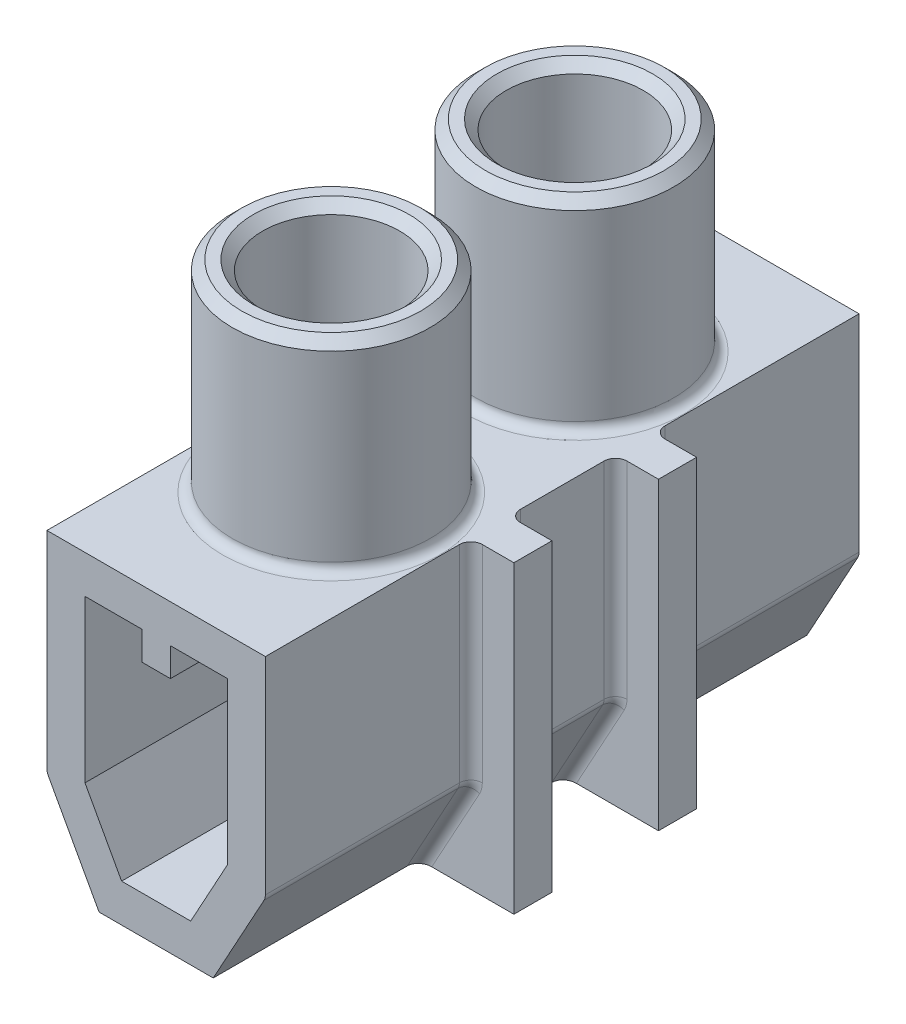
from build123d import *

# Parameters (mm, degrees)
EXTRU_MINCE1_DEPTH      = 7.8
BOSS_EXTRU_3_REACH      = 15.451
BOSS_EXTRU_3_START      = 4
CONG_2_R                = 0.3
ESQUISSE4_R             = 2.6000000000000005
ESQUISSE4_R_2           = 1.8000000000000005
EXTRU_MINCE3_DEPTH      = 5.3
CONG_1_R                = 0.25
CHANFREIN1_SIZE         = 0.25
ENL_V_MAT_EXTRU_1_REACH = 13.868
ESQUISSE5_R             = 1.7999999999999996
BOSS_EXTRU_2_DEPTH      = 2.5


with BuildPart() as part:
    # Esquisse1 → Extru.-Mince1 (new body)
    with BuildSketch(Plane.XY):
        Polygon((0, 4.5), (2.87, 4.5), (2.870000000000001, -1.0000000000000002), (1.5, -3.5), (0, -3.5000000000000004), (-3e-16, -2.5000000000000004), (0.907691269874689, -2.5), (1.870000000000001, -0.7439621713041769), (1.87, 3.5), (0, 3.5), align=None)
    extrude(amount=EXTRU_MINCE1_DEPTH)

    # Esquisse7 → Boss.-Extru.3 (add, up to next)
    with BuildSketch(Plane(origin=(0, 0, 0), x_dir=(0, 0, -1), z_dir=(1, 0, 0)).offset(BOSS_EXTRU_3_START), mode=Mode.PRIVATE) as boss_extru_3_sk1:
        Polygon((-2.4000000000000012, 4.5), (-1.400000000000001, 4.5), (-1.400000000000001, -3.5), (-2.4000000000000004, -3.5), align=None)
    boss_extru_3_tool1 = extrude(boss_extru_3_sk1.sketch, amount=-BOSS_EXTRU_3_REACH, mode=Mode.PRIVATE) - part.part
    add(boss_extru_3_tool1.solids().sort_by_distance((4, 0.5, 1.9))[0])

    # Cong_2
    cong_2_edges = [part.edges().sort_by_distance(p)[0] for p in [
        (2.870000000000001, -1.0000000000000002, 5.1),
        (2.870000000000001, -1.0000000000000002, 0.7000000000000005),
        (2.870000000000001, 1.75, 2.400000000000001),
        (2.8700000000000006, 1.75, 1.400000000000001),
        (2.1850000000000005, -2.25, 2.400000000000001),
        (2.1850000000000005, -2.2500000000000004, 1.4000000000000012),
    ]]
    fillet(cong_2_edges, radius=CONG_2_R)

    # Sym_trie1: part across plane


with BuildPart() as part_1:
    add(part.part)
    add(part.part.mirror(Plane(origin=(0, 3.4999999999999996, 7.8), x_dir=(0, 0, 1), z_dir=(-1, 0, 0))))

    # Esquisse4 → Extru.-Mince3 (add)
    with BuildSketch(Plane(origin=(0, 4.5, 0), x_dir=(1, 0, 0), z_dir=(0, 1, 0))):
        with Locations((0, -3.1999999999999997)):
            Circle(ESQUISSE4_R)
        with Locations((0, -3.1999999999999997)):
            Circle(ESQUISSE4_R_2, mode=Mode.SUBTRACT)
    extrude(amount=EXTRU_MINCE3_DEPTH)

    # Cong_1
    cong_1_edges = [part_1.edges().sort_by_distance(p)[0] for p in [
        (-2.6000000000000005, 4.5, 3.1999999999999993),
    ]]
    fillet(cong_1_edges, radius=CONG_1_R)

    # Chanfrein1
    chanfrein1_edges = [part_1.edges().sort_by_distance(p)[0] for p in [
        (-2.6000000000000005, 9.8, 3.1999999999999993),
        (-1.8000000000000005, 9.8, 3.1999999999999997),
    ]]
    chamfer(chanfrein1_edges, length=CHANFREIN1_SIZE)

    # Esquisse5 → Enl_v. mat.-Extru.1 (cut, up to next)
    with BuildSketch(Plane(origin=(0, 4.5, 0), x_dir=(1, 0, 0), z_dir=(0, 1, 0)), mode=Mode.PRIVATE) as enl_v_mat_extru_1_sk1:
        with Locations(Location((0, -3.1999999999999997, 0), (0, 0, 270))):
            Circle(ESQUISSE5_R)
    enl_v_mat_extru_1_tool1 = extrude(enl_v_mat_extru_1_sk1.sketch, amount=-ENL_V_MAT_EXTRU_1_REACH, mode=Mode.PRIVATE) & part_1.part
    add(enl_v_mat_extru_1_tool1.solids().sort_by_distance((0, 4.5, 3.2))[0], mode=Mode.SUBTRACT)

    # Sym_trie2: part across face


with BuildPart() as part_2:
    add(part_1.part)
    add(part_1.part.mirror(Plane(origin=(0, 0.811208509, 0), x_dir=(1, 0, 0), z_dir=(0, 0, -1))))

    # Esquisse6 → Boss.-Extru.2 (add)
    with BuildSketch(Plane.XY.offset(7.8)):
        Polygon((-0.37499999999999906, 3.4999999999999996), (0.3750000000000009, 3.4999999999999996), (0.37500000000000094, 2.75), (-0.3749999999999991, 2.75), align=None)
    extrude(amount=-BOSS_EXTRU_2_DEPTH)


solid = part_2.part
